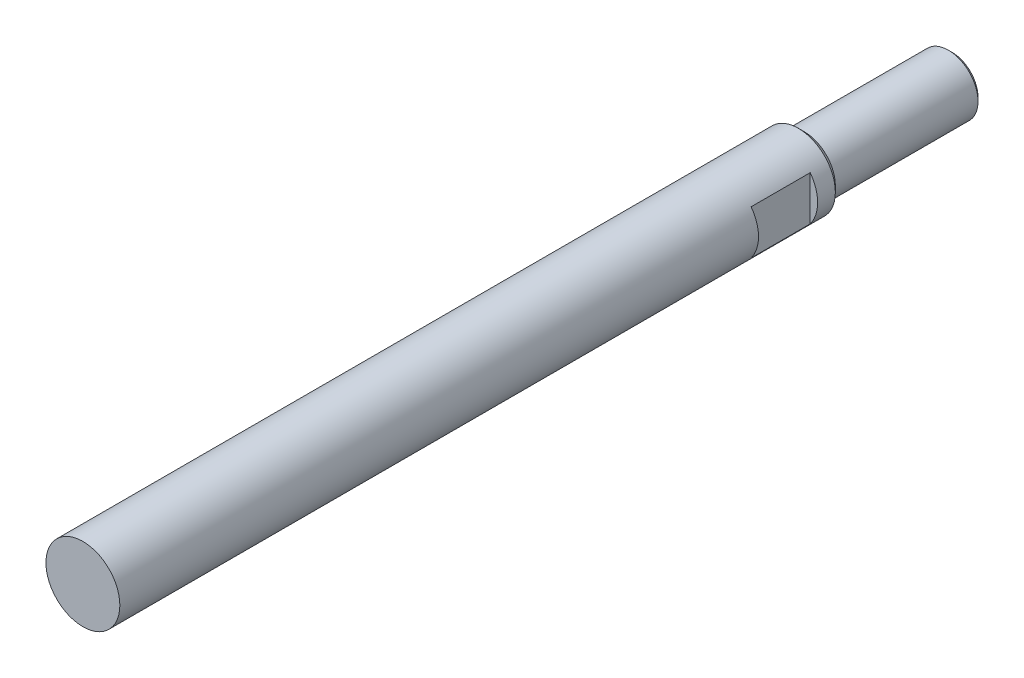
ISO-10303-21;
HEADER;
FILE_DESCRIPTION(('STEP AP214'),'2;1');
FILE_NAME('part.step','',(''),(''),'','','');
FILE_SCHEMA(('AUTOMOTIVE_DESIGN { 1 0 10303 214 1 1 1 1 }'));
ENDSEC;
DATA;
#1=APPLICATION_CONTEXT('core data for automotive mechanical design processes');
#2=APPLICATION_PROTOCOL_DEFINITION('international standard','automotive_design',2000,#1);
#3=PRODUCT_CONTEXT('',#1,'mechanical');
#4=PRODUCT('Part','Part','',(#3));
#5=PRODUCT_RELATED_PRODUCT_CATEGORY('part','',(#4));
#6=PRODUCT_DEFINITION_FORMATION('','',#4);
#7=PRODUCT_DEFINITION_CONTEXT('part definition',#1,'design');
#8=PRODUCT_DEFINITION('design','',#6,#7);
#9=PRODUCT_DEFINITION_SHAPE('','',#8);
#10=(LENGTH_UNIT() NAMED_UNIT(*) SI_UNIT(.MILLI.,.METRE.));
#11=(NAMED_UNIT(*) PLANE_ANGLE_UNIT() SI_UNIT($,.RADIAN.));
#12=(NAMED_UNIT(*) SI_UNIT($,.STERADIAN.) SOLID_ANGLE_UNIT());
#13=UNCERTAINTY_MEASURE_WITH_UNIT(LENGTH_MEASURE(1.E-05),#10,'distance_accuracy_value','');
#14=(GEOMETRIC_REPRESENTATION_CONTEXT(3) GLOBAL_UNCERTAINTY_ASSIGNED_CONTEXT((#13)) GLOBAL_UNIT_ASSIGNED_CONTEXT((#10,
#11,#12)) REPRESENTATION_CONTEXT('',''));
#15=CARTESIAN_POINT('',(0.,0.,0.));
#16=DIRECTION('',(0.,0.,1.));
#17=DIRECTION('',(1.,0.,0.));
#18=AXIS2_PLACEMENT_3D('',#15,#16,#17);
#19=CARTESIAN_POINT('',(0.,0.,0.));
#20=DIRECTION('',(0.,0.,1.));
#21=DIRECTION('',(1.,0.,0.));
#22=AXIS2_PLACEMENT_3D('',#19,#20,#21);
#23=PLANE('',#22);
#24=CARTESIAN_POINT('',(0.,0.,0.));
#25=DIRECTION('',(0.,0.,1.));
#26=DIRECTION('',(1.,0.,0.));
#27=AXIS2_PLACEMENT_3D('',#24,#25,#26);
#28=CIRCLE('',#27,10.4999999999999);
#29=CARTESIAN_POINT('',(10.499999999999,1.37251321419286E-13,0.));
#30=VERTEX_POINT('',#29);
#31=EDGE_CURVE('E99',#30,#30,#28,.F.);
#32=ORIENTED_EDGE('',*,*,#31,.T.);
#33=EDGE_LOOP('',(#32));
#34=FACE_BOUND('',#33,.T.);
#35=CARTESIAN_POINT('',(0.,0.,0.));
#36=DIRECTION('',(0.,0.,1.));
#37=DIRECTION('',(1.,0.,0.));
#38=AXIS2_PLACEMENT_3D('',#35,#36,#37);
#39=CIRCLE('',#38,10.);
#40=CARTESIAN_POINT('',(9.99999999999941,-2.11497486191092E-13,0.));
#41=VERTEX_POINT('',#40);
#42=EDGE_CURVE('E111',#41,#41,#39,.F.);
#43=ORIENTED_EDGE('',*,*,#42,.F.);
#44=EDGE_LOOP('',(#43));
#45=FACE_BOUND('',#44,.T.);
#46=ADVANCED_FACE('F32',(#34,#45),#23,.F.);
#47=CARTESIAN_POINT('',(-8.04911692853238E-13,-5.82867087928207E-13,244.));
#48=DIRECTION('',(0.,0.,-1.));
#49=DIRECTION('',(-1.,0.,0.));
#50=AXIS2_PLACEMENT_3D('',#47,#48,#49);
#51=CYLINDRICAL_SURFACE('',#50,12.5);
#52=DIRECTION('',(0.,0.,-1.));
#53=VECTOR('',#52,1.);
#54=CARTESIAN_POINT('',(-10.0000000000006,-7.50000000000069,244.));
#55=LINE('',#54,#53);
#56=CARTESIAN_POINT('',(-10.0000000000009,-7.50000000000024,27.9929982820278));
#57=VERTEX_POINT('',#56);
#58=CARTESIAN_POINT('',(-10.000000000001,-7.50000000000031,7.99299828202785));
#59=VERTEX_POINT('',#58);
#60=EDGE_CURVE('E40',#57,#59,#55,.T.);
#61=ORIENTED_EDGE('',*,*,#60,.T.);
#62=CARTESIAN_POINT('',(-6.66133814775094E-13,-2.56739074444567E-13,7.99299828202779));
#63=DIRECTION('',(0.,0.,-1.));
#64=DIRECTION('',(-1.,0.,0.));
#65=AXIS2_PLACEMENT_3D('',#62,#63,#64);
#66=CIRCLE('',#65,12.5);
#67=CARTESIAN_POINT('',(-10.0000000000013,7.49999999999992,7.99299828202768));
#68=VERTEX_POINT('',#67);
#69=EDGE_CURVE('E11',#59,#68,#66,.T.);
#70=ORIENTED_EDGE('',*,*,#69,.T.);
#71=DIRECTION('',(0.,0.,-1.));
#72=VECTOR('',#71,1.);
#73=CARTESIAN_POINT('',(-10.000000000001,7.49999999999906,244.));
#74=LINE('',#73,#72);
#75=CARTESIAN_POINT('',(-10.0000000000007,7.49999999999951,27.9929982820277));
#76=VERTEX_POINT('',#75);
#77=EDGE_CURVE('E76',#68,#76,#74,.F.);
#78=ORIENTED_EDGE('',*,*,#77,.T.);
#79=CARTESIAN_POINT('',(-7.21644966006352E-13,-5.13478148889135E-13,27.9929982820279));
#80=DIRECTION('',(0.,0.,1.));
#81=DIRECTION('',(1.,0.,0.));
#82=AXIS2_PLACEMENT_3D('',#79,#80,#81);
#83=CIRCLE('',#82,12.5);
#84=EDGE_CURVE('E71',#76,#57,#83,.T.);
#85=ORIENTED_EDGE('',*,*,#84,.T.);
#86=EDGE_LOOP('',(#61,#70,#78,#85));
#87=FACE_BOUND('',#86,.T.);
#88=DIRECTION('',(0.,0.,-1.));
#89=VECTOR('',#88,1.);
#90=CARTESIAN_POINT('',(9.99999999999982,-7.50000000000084,243.999999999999));
#91=LINE('',#90,#89);
#92=CARTESIAN_POINT('',(9.99999999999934,-7.50000000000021,7.9929982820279));
#93=VERTEX_POINT('',#92);
#94=CARTESIAN_POINT('',(9.99999999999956,-7.50000000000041,27.9929982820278));
#95=VERTEX_POINT('',#94);
#96=EDGE_CURVE('E93',#93,#95,#91,.F.);
#97=ORIENTED_EDGE('',*,*,#96,.T.);
#98=CARTESIAN_POINT('',(-7.21644966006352E-13,-5.13478148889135E-13,27.9929982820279));
#99=DIRECTION('',(0.,0.,0.999999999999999));
#100=DIRECTION('',(1.,0.,0.));
#101=AXIS2_PLACEMENT_3D('',#98,#99,#100);
#102=CIRCLE('',#101,12.5);
#103=CARTESIAN_POINT('',(9.99999999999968,7.4999999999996,27.9929982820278));
#104=VERTEX_POINT('',#103);
#105=EDGE_CURVE('E77',#95,#104,#102,.T.);
#106=ORIENTED_EDGE('',*,*,#105,.T.);
#107=DIRECTION('',(0.,0.,-1.));
#108=VECTOR('',#107,1.);
#109=CARTESIAN_POINT('',(9.99999999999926,7.49999999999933,243.999999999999));
#110=LINE('',#109,#108);
#111=CARTESIAN_POINT('',(9.99999999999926,7.50000000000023,7.99299828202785));
#112=VERTEX_POINT('',#111);
#113=EDGE_CURVE('E90',#104,#112,#110,.T.);
#114=ORIENTED_EDGE('',*,*,#113,.T.);
#115=CARTESIAN_POINT('',(-6.66133814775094E-13,-2.56739074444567E-13,7.99299828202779));
#116=DIRECTION('',(0.,0.,-1.));
#117=DIRECTION('',(-1.,0.,0.));
#118=AXIS2_PLACEMENT_3D('',#115,#116,#117);
#119=CIRCLE('',#118,12.5);
#120=EDGE_CURVE('E96',#112,#93,#119,.T.);
#121=ORIENTED_EDGE('',*,*,#120,.T.);
#122=EDGE_LOOP('',(#97,#106,#114,#121));
#123=FACE_BOUND('',#122,.T.);
#124=CARTESIAN_POINT('',(-7.7715611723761E-13,1.38777878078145E-13,2.00000000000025));
#125=DIRECTION('',(0.,0.,1.));
#126=DIRECTION('',(1.,0.,0.));
#127=AXIS2_PLACEMENT_3D('',#124,#125,#126);
#128=CIRCLE('',#127,12.5);
#129=CARTESIAN_POINT('',(12.4999999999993,1.31145094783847E-13,2.00000000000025));
#130=VERTEX_POINT('',#129);
#131=EDGE_CURVE('E102',#130,#130,#128,.T.);
#132=ORIENTED_EDGE('',*,*,#131,.T.);
#133=EDGE_LOOP('',(#132));
#134=FACE_BOUND('',#133,.T.);
#135=CARTESIAN_POINT('',(-8.04911692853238E-13,-5.82867087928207E-13,244.));
#136=DIRECTION('',(0.,0.,1.));
#137=DIRECTION('',(1.,0.,0.));
#138=AXIS2_PLACEMENT_3D('',#135,#136,#137);
#139=CIRCLE('',#138,12.5);
#140=CARTESIAN_POINT('',(12.4999999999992,-5.90499871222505E-13,244.));
#141=VERTEX_POINT('',#140);
#142=EDGE_CURVE('E114',#141,#141,#139,.T.);
#143=ORIENTED_EDGE('',*,*,#142,.F.);
#144=EDGE_LOOP('',(#143));
#145=FACE_BOUND('',#144,.T.);
#146=ADVANCED_FACE('F34',(#87,#123,#134,#145),#51,.T.);
#147=CARTESIAN_POINT('',(-8.04911692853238E-13,-5.82867087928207E-13,244.));
#148=DIRECTION('',(0.,0.,1.));
#149=DIRECTION('',(1.,0.,0.));
#150=AXIS2_PLACEMENT_3D('',#147,#148,#149);
#151=PLANE('',#150);
#152=ORIENTED_EDGE('',*,*,#142,.T.);
#153=EDGE_LOOP('',(#152));
#154=FACE_BOUND('',#153,.T.);
#155=ADVANCED_FACE('F139',(#154),#151,.T.);
#156=CARTESIAN_POINT('',(-6.38378239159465E-13,0.,-49.9999999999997));
#157=DIRECTION('',(0.,0.,1.));
#158=DIRECTION('',(1.,0.,0.));
#159=AXIS2_PLACEMENT_3D('',#156,#157,#158);
#160=CYLINDRICAL_SURFACE('',#159,10.);
#161=CARTESIAN_POINT('',(-4.44089209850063E-13,-1.73472347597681E-13,-48.7499999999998));
#162=DIRECTION('',(0.,0.,-1.));
#163=DIRECTION('',(-1.,0.,0.));
#164=AXIS2_PLACEMENT_3D('',#161,#162,#163);
#165=CIRCLE('',#164,10.);
#166=CARTESIAN_POINT('',(9.9999999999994,0.,-48.7499999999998));
#167=VERTEX_POINT('',#166);
#168=EDGE_CURVE('E105',#167,#167,#165,.F.);
#169=CARTESIAN_POINT('',(9.9999999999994,0.,-48.7499999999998));
#170=CARTESIAN_POINT('',(9.9999999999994,0.,-48.2421874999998));
#171=CARTESIAN_POINT('',(9.9999999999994,0.,-47.7343749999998));
#172=CARTESIAN_POINT('',(9.9999999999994,0.,-46.7187499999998));
#173=CARTESIAN_POINT('',(9.9999999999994,0.,-46.2109374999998));
#174=CARTESIAN_POINT('',(9.9999999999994,-1.01108357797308E-13,-45.1953124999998));
#175=CARTESIAN_POINT('',(9.9999999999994,-1.02348685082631E-13,-44.6874999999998));
#176=CARTESIAN_POINT('',(9.9999999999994,-1.04829339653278E-13,-43.6718749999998));
#177=CARTESIAN_POINT('',(9.9999999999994,-1.06069666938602E-13,-43.1640624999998));
#178=CARTESIAN_POINT('',(9.9999999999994,-1.08550321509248E-13,-42.1484374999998));
#179=CARTESIAN_POINT('',(9.9999999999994,-1.09790648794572E-13,-41.6406249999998));
#180=CARTESIAN_POINT('',(9.9999999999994,-1.12271303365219E-13,-40.6249999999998));
#181=CARTESIAN_POINT('',(9.9999999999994,-1.13511630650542E-13,-40.1171874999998));
#182=CARTESIAN_POINT('',(9.9999999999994,-1.15992285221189E-13,-39.1015624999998));
#183=CARTESIAN_POINT('',(9.9999999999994,-1.17232612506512E-13,-38.5937499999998));
#184=CARTESIAN_POINT('',(9.9999999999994,-1.19713267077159E-13,-37.5781249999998));
#185=CARTESIAN_POINT('',(9.9999999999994,-1.20953594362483E-13,-37.0703124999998));
#186=CARTESIAN_POINT('',(9.9999999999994,-1.23434248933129E-13,-36.0546874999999));
#187=CARTESIAN_POINT('',(9.9999999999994,-1.24674576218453E-13,-35.5468749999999));
#188=CARTESIAN_POINT('',(9.9999999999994,-1.271552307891E-13,-34.5312499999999));
#189=CARTESIAN_POINT('',(9.9999999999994,-1.28395558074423E-13,-34.0234374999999));
#190=CARTESIAN_POINT('',(9.9999999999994,-1.3087621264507E-13,-33.0078124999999));
#191=CARTESIAN_POINT('',(9.9999999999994,-1.32116539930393E-13,-32.4999999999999));
#192=CARTESIAN_POINT('',(9.9999999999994,-1.3459719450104E-13,-31.4843749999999));
#193=CARTESIAN_POINT('',(9.9999999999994,-1.35837521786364E-13,-30.9765624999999));
#194=CARTESIAN_POINT('',(9.9999999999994,-1.3831817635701E-13,-29.9609374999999));
#195=CARTESIAN_POINT('',(9.9999999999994,-1.39558503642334E-13,-29.4531249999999));
#196=CARTESIAN_POINT('',(9.9999999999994,-1.42039158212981E-13,-28.4374999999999));
#197=CARTESIAN_POINT('',(9.9999999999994,-1.43279485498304E-13,-27.9296874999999));
#198=CARTESIAN_POINT('',(9.9999999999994,-1.45760140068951E-13,-26.9140624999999));
#199=CARTESIAN_POINT('',(9.9999999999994,-1.47000467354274E-13,-26.4062499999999));
#200=CARTESIAN_POINT('',(9.9999999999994,-1.49481121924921E-13,-25.3906249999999));
#201=CARTESIAN_POINT('',(9.9999999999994,-1.50721449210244E-13,-24.8828124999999));
#202=CARTESIAN_POINT('',(9.9999999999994,-1.53202103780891E-13,-23.8671874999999));
#203=CARTESIAN_POINT('',(9.9999999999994,-1.54442431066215E-13,-23.3593749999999));
#204=CARTESIAN_POINT('',(9.9999999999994,-1.56923085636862E-13,-22.3437499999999));
#205=CARTESIAN_POINT('',(9.9999999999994,-1.58163412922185E-13,-21.8359374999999));
#206=CARTESIAN_POINT('',(9.9999999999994,-1.60644067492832E-13,-20.8203124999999));
#207=CARTESIAN_POINT('',(9.9999999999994,-1.61884394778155E-13,-20.3124999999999));
#208=CARTESIAN_POINT('',(9.9999999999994,-1.64365049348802E-13,-19.2968749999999));
#209=CARTESIAN_POINT('',(9.9999999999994,-1.65605376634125E-13,-18.7890624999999));
#210=CARTESIAN_POINT('',(9.9999999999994,-1.68086031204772E-13,-17.7734374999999));
#211=CARTESIAN_POINT('',(9.9999999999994,-1.69326358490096E-13,-17.2656249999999));
#212=CARTESIAN_POINT('',(9.9999999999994,-1.71807013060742E-13,-16.2499999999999));
#213=CARTESIAN_POINT('',(9.9999999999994,-1.73047340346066E-13,-15.7421874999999));
#214=CARTESIAN_POINT('',(9.9999999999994,-1.75527994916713E-13,-14.7265624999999));
#215=CARTESIAN_POINT('',(9.9999999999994,-1.76768322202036E-13,-14.2187499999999));
#216=CARTESIAN_POINT('',(9.9999999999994,-1.79248976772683E-13,-13.2031249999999));
#217=CARTESIAN_POINT('',(9.9999999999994,-1.80489304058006E-13,-12.6953124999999));
#218=CARTESIAN_POINT('',(9.9999999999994,-1.82969958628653E-13,-11.6796875));
#219=CARTESIAN_POINT('',(9.9999999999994,-1.84210285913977E-13,-11.171875));
#220=CARTESIAN_POINT('',(9.9999999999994,-1.86690940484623E-13,-10.15625));
#221=CARTESIAN_POINT('',(9.9999999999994,-1.87931267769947E-13,-9.64843749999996));
#222=CARTESIAN_POINT('',(9.9999999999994,-1.90411922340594E-13,-8.63281249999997));
#223=CARTESIAN_POINT('',(9.9999999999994,-1.91652249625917E-13,-8.12499999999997));
#224=CARTESIAN_POINT('',(9.9999999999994,-1.94132904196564E-13,-7.10937499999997));
#225=CARTESIAN_POINT('',(9.99999999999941,-1.95373231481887E-13,-6.60156249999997));
#226=CARTESIAN_POINT('',(9.99999999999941,-1.97853886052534E-13,-5.58593749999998));
#227=CARTESIAN_POINT('',(9.99999999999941,-1.99094213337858E-13,-5.07812499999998));
#228=CARTESIAN_POINT('',(9.99999999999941,-2.01574867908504E-13,-4.06249999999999));
#229=CARTESIAN_POINT('',(9.99999999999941,-2.02815195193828E-13,-3.55468749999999));
#230=CARTESIAN_POINT('',(9.99999999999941,-2.05295849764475E-13,-2.53906249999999));
#231=CARTESIAN_POINT('',(9.99999999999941,-2.06536177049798E-13,-2.03124999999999));
#232=CARTESIAN_POINT('',(9.99999999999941,-2.09016831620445E-13,-1.015625));
#233=CARTESIAN_POINT('',(9.99999999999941,-2.10257158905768E-13,-0.507812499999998));
#234=CARTESIAN_POINT('',(9.99999999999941,-2.11497486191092E-13,0.));
#235=B_SPLINE_CURVE_WITH_KNOTS('',3,(#169,#170,#171,#172,#173,#174,#175,#176,#177,#178,#179,
#180,#181,#182,#183,#184,#185,#186,#187,#188,#189,#190,#191,#192,#193,#194,#195,#196,#197,#198,
#199,#200,#201,#202,#203,#204,#205,#206,#207,#208,#209,#210,#211,#212,#213,#214,#215,#216,#217,
#218,#219,#220,#221,#222,#223,#224,#225,#226,#227,#228,#229,#230,#231,#232,#233,#234),
.UNSPECIFIED.,.F.,.F.,(4,2,2,2,2,2,2,2,2,2,2,2,2,2,2,2,2,2,2,2,2,2,2,2,2,2,2,2,2,2,2,2,4),(0.,
1.5234375,3.04687499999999,4.57031249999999,6.09374999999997,7.61718749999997,9.14062499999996,
10.6640625,12.1875,13.7109374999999,15.2343749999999,16.7578124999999,18.2812499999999,
19.8046874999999,21.3281249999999,22.8515624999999,24.3749999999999,25.8984374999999,
27.4218749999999,28.9453124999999,30.4687499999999,31.9921874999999,33.5156249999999,
35.0390624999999,36.5624999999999,38.0859374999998,39.6093749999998,41.1328124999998,
42.6562499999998,44.1796874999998,45.7031249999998,47.2265624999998,48.7499999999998),.UNSPECIFIED.);
#236=EDGE_CURVE('BSEAM142',#167,#41,#235,.T.);
#237=ORIENTED_EDGE('',*,*,#168,.T.);
#238=ORIENTED_EDGE('',*,*,#42,.T.);
#239=ORIENTED_EDGE('',*,*,#236,.T.);
#240=ORIENTED_EDGE('',*,*,#236,.F.);
#241=EDGE_LOOP('',(#237,#239,#238,#240));
#242=FACE_BOUND('',#241,.T.);
#243=ADVANCED_FACE('F142',(#242),#160,.T.);
#244=CARTESIAN_POINT('',(-6.38378239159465E-13,0.,-49.9999999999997));
#245=DIRECTION('',(0.,0.,-1.));
#246=DIRECTION('',(-1.,0.,0.));
#247=AXIS2_PLACEMENT_3D('',#244,#245,#246);
#248=PLANE('',#247);
#249=CARTESIAN_POINT('',(-6.38378239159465E-13,0.,-49.9999999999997));
#250=DIRECTION('',(0.,0.,-1.));
#251=DIRECTION('',(-1.,0.,0.));
#252=AXIS2_PLACEMENT_3D('',#249,#250,#251);
#253=CIRCLE('',#252,8.75);
#254=CARTESIAN_POINT('',(8.7499999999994,0.,-49.9999999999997));
#255=VERTEX_POINT('',#254);
#256=EDGE_CURVE('E108',#255,#255,#253,.T.);
#257=ORIENTED_EDGE('',*,*,#256,.T.);
#258=EDGE_LOOP('',(#257));
#259=FACE_BOUND('',#258,.T.);
#260=ADVANCED_FACE('F149',(#259),#248,.T.);
#261=CARTESIAN_POINT('',(-6.38378239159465E-13,0.,-49.9999999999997));
#262=DIRECTION('',(0.,0.,1.));
#263=DIRECTION('',(1.,0.,0.));
#264=AXIS2_PLACEMENT_3D('',#261,#262,#263);
#265=CONICAL_SURFACE('',#264,8.75,0.785398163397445);
#266=CARTESIAN_POINT('',(9.9999999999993,0.,-48.7499999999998));
#267=CARTESIAN_POINT('',(9.98697916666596,0.,-48.7630208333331));
#268=CARTESIAN_POINT('',(9.97395833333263,0.,-48.7760416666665));
#269=CARTESIAN_POINT('',(9.94791666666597,0.,-48.8020833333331));
#270=CARTESIAN_POINT('',(9.93489583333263,0.,-48.8151041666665));
#271=CARTESIAN_POINT('',(9.90885416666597,0.,-48.8411458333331));
#272=CARTESIAN_POINT('',(9.89583333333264,0.,-48.8541666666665));
#273=CARTESIAN_POINT('',(9.86979166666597,0.,-48.8802083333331));
#274=CARTESIAN_POINT('',(9.85677083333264,0.,-48.8932291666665));
#275=CARTESIAN_POINT('',(9.83072916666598,0.,-48.9192708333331));
#276=CARTESIAN_POINT('',(9.81770833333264,0.,-48.9322916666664));
#277=CARTESIAN_POINT('',(9.79166666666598,0.,-48.9583333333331));
#278=CARTESIAN_POINT('',(9.77864583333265,0.,-48.9713541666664));
#279=CARTESIAN_POINT('',(9.75260416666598,0.,-48.9973958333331));
#280=CARTESIAN_POINT('',(9.73958333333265,0.,-49.0104166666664));
#281=CARTESIAN_POINT('',(9.71354166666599,0.,-49.0364583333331));
#282=CARTESIAN_POINT('',(9.70052083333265,0.,-49.0494791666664));
#283=CARTESIAN_POINT('',(9.67447916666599,0.,-49.0755208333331));
#284=CARTESIAN_POINT('',(9.66145833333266,0.,-49.0885416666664));
#285=CARTESIAN_POINT('',(9.63541666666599,0.,-49.1145833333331));
#286=CARTESIAN_POINT('',(9.62239583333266,0.,-49.1276041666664));
#287=CARTESIAN_POINT('',(9.59635416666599,0.,-49.1536458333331));
#288=CARTESIAN_POINT('',(9.58333333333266,0.,-49.1666666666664));
#289=CARTESIAN_POINT('',(9.557291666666,0.,-49.1927083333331));
#290=CARTESIAN_POINT('',(9.54427083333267,0.,-49.2057291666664));
#291=CARTESIAN_POINT('',(9.518229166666,0.,-49.2317708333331));
#292=CARTESIAN_POINT('',(9.50520833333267,0.,-49.2447916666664));
#293=CARTESIAN_POINT('',(9.479166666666,0.,-49.2708333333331));
#294=CARTESIAN_POINT('',(9.46614583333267,0.,-49.2838541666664));
#295=CARTESIAN_POINT('',(9.44010416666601,0.,-49.3098958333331));
#296=CARTESIAN_POINT('',(9.42708333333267,0.,-49.3229166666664));
#297=CARTESIAN_POINT('',(9.40104166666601,0.,-49.3489583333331));
#298=CARTESIAN_POINT('',(9.38802083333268,0.,-49.3619791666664));
#299=CARTESIAN_POINT('',(9.36197916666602,0.,-49.3880208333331));
#300=CARTESIAN_POINT('',(9.34895833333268,0.,-49.4010416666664));
#301=CARTESIAN_POINT('',(9.32291666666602,0.,-49.4270833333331));
#302=CARTESIAN_POINT('',(9.30989583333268,0.,-49.4401041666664));
#303=CARTESIAN_POINT('',(9.28385416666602,0.,-49.4661458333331));
#304=CARTESIAN_POINT('',(9.27083333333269,0.,-49.4791666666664));
#305=CARTESIAN_POINT('',(9.24479166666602,0.,-49.5052083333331));
#306=CARTESIAN_POINT('',(9.23177083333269,0.,-49.5182291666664));
#307=CARTESIAN_POINT('',(9.20572916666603,0.,-49.5442708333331));
#308=CARTESIAN_POINT('',(9.1927083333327,0.,-49.5572916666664));
#309=CARTESIAN_POINT('',(9.16666666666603,0.,-49.5833333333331));
#310=CARTESIAN_POINT('',(9.1536458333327,0.,-49.5963541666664));
#311=CARTESIAN_POINT('',(9.12760416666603,0.,-49.6223958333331));
#312=CARTESIAN_POINT('',(9.1145833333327,0.,-49.6354166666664));
#313=CARTESIAN_POINT('',(9.08854166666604,0.,-49.6614583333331));
#314=CARTESIAN_POINT('',(9.07552083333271,0.,-49.6744791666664));
#315=CARTESIAN_POINT('',(9.04947916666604,0.,-49.7005208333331));
#316=CARTESIAN_POINT('',(9.03645833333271,0.,-49.7135416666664));
#317=CARTESIAN_POINT('',(9.01041666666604,0.,-49.7395833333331));
#318=CARTESIAN_POINT('',(8.99739583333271,0.,-49.7526041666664));
#319=CARTESIAN_POINT('',(8.97135416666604,0.,-49.7786458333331));
#320=CARTESIAN_POINT('',(8.95833333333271,0.,-49.7916666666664));
#321=CARTESIAN_POINT('',(8.93229166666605,0.,-49.8177083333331));
#322=CARTESIAN_POINT('',(8.91927083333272,0.,-49.8307291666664));
#323=CARTESIAN_POINT('',(8.89322916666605,0.,-49.856770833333));
#324=CARTESIAN_POINT('',(8.88020833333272,0.,-49.8697916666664));
#325=CARTESIAN_POINT('',(8.85416666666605,0.,-49.895833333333));
#326=CARTESIAN_POINT('',(8.84114583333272,0.,-49.9088541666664));
#327=CARTESIAN_POINT('',(8.81510416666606,0.,-49.934895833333));
#328=CARTESIAN_POINT('',(8.80208333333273,0.,-49.9479166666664));
#329=CARTESIAN_POINT('',(8.77604166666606,0.,-49.973958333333));
#330=CARTESIAN_POINT('',(8.76302083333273,0.,-49.9869791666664));
#331=CARTESIAN_POINT('',(8.7499999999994,0.,-49.9999999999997));
#332=B_SPLINE_CURVE_WITH_KNOTS('',3,(#266,#267,#268,#269,#270,#271,#272,#273,#274,#275,#276,
#277,#278,#279,#280,#281,#282,#283,#284,#285,#286,#287,#288,#289,#290,#291,#292,#293,#294,#295,
#296,#297,#298,#299,#300,#301,#302,#303,#304,#305,#306,#307,#308,#309,#310,#311,#312,#313,#314,
#315,#316,#317,#318,#319,#320,#321,#322,#323,#324,#325,#326,#327,#328,#329,#330,#331),
.UNSPECIFIED.,.F.,.F.,(4,2,2,2,2,2,2,2,2,2,2,2,2,2,2,2,2,2,2,2,2,2,2,2,2,2,2,2,2,2,2,2,4),(0.,
0.0552427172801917,0.110485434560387,0.165728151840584,0.220970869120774,0.276213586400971,
0.331456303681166,0.386699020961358,0.441941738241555,0.49718445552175,0.552427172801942,
0.607669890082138,0.662912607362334,0.718155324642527,0.773398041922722,0.828640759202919,
0.883883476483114,0.939126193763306,0.994368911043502,1.0496116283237,1.10485434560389,
1.16009706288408,1.21533978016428,1.27058249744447,1.32582521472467,1.38106793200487,
1.43631064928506,1.49155336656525,1.54679608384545,1.60203880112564,1.65728151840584,
1.71252423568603,1.76776695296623),.UNSPECIFIED.);
#333=EDGE_CURVE('BSEAM156',#167,#255,#332,.T.);
#334=ORIENTED_EDGE('',*,*,#168,.F.);
#335=ORIENTED_EDGE('',*,*,#256,.F.);
#336=ORIENTED_EDGE('',*,*,#333,.T.);
#337=ORIENTED_EDGE('',*,*,#333,.F.);
#338=EDGE_LOOP('',(#334,#336,#335,#337));
#339=FACE_BOUND('',#338,.T.);
#340=ADVANCED_FACE('F156',(#339),#265,.T.);
#341=CARTESIAN_POINT('',(-7.7715611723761E-13,1.38777878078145E-13,2.00000000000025));
#342=DIRECTION('',(0.,0.,1.));
#343=DIRECTION('',(1.,0.,0.));
#344=AXIS2_PLACEMENT_3D('',#341,#342,#343);
#345=CONICAL_SURFACE('',#344,12.5,0.785398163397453);
#346=CARTESIAN_POINT('',(10.499999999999,1.37251321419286E-13,0.));
#347=CARTESIAN_POINT('',(10.5208333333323,1.37187714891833E-13,0.0208333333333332));
#348=CARTESIAN_POINT('',(10.5416666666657,1.37124108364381E-13,0.0416666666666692));
#349=CARTESIAN_POINT('',(10.5833333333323,1.36996895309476E-13,0.0833333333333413));
#350=CARTESIAN_POINT('',(10.6041666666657,1.36933288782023E-13,0.104166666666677));
#351=CARTESIAN_POINT('',(10.6458333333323,1.36806075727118E-13,0.145833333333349));
#352=CARTESIAN_POINT('',(10.6666666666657,1.36742469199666E-13,0.166666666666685));
#353=CARTESIAN_POINT('',(10.7083333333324,1.36615256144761E-13,0.208333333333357));
#354=CARTESIAN_POINT('',(10.7291666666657,1.36551649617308E-13,0.229166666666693));
#355=CARTESIAN_POINT('',(10.7708333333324,1.36424436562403E-13,0.270833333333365));
#356=CARTESIAN_POINT('',(10.7916666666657,1.36360830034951E-13,0.2916666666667));
#357=CARTESIAN_POINT('',(10.8333333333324,1.36233616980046E-13,0.333333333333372));
#358=CARTESIAN_POINT('',(10.8541666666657,1.36170010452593E-13,0.354166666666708));
#359=CARTESIAN_POINT('',(10.8958333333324,1.36042797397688E-13,0.395833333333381));
#360=CARTESIAN_POINT('',(10.9166666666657,1.35979190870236E-13,0.416666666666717));
#361=CARTESIAN_POINT('',(10.9583333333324,1.35851977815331E-13,0.458333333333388));
#362=CARTESIAN_POINT('',(10.9791666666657,1.35788371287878E-13,0.479166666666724));
#363=CARTESIAN_POINT('',(11.0208333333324,1.35661158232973E-13,0.520833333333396));
#364=CARTESIAN_POINT('',(11.0416666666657,1.35597551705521E-13,0.541666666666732));
#365=CARTESIAN_POINT('',(11.0833333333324,1.35470338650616E-13,0.583333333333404));
#366=CARTESIAN_POINT('',(11.1041666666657,1.35406732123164E-13,0.60416666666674));
#367=CARTESIAN_POINT('',(11.1458333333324,1.35279519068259E-13,0.645833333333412));
#368=CARTESIAN_POINT('',(11.1666666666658,1.35215912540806E-13,0.666666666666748));
#369=CARTESIAN_POINT('',(11.2083333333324,1.35088699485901E-13,0.70833333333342));
#370=CARTESIAN_POINT('',(11.2291666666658,1.35025092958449E-13,0.729166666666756));
#371=CARTESIAN_POINT('',(11.2708333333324,1.34897879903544E-13,0.770833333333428));
#372=CARTESIAN_POINT('',(11.2916666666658,1.34834273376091E-13,0.791666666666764));
#373=CARTESIAN_POINT('',(11.3333333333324,1.34707060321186E-13,0.833333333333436));
#374=CARTESIAN_POINT('',(11.3541666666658,1.34643453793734E-13,0.854166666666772));
#375=CARTESIAN_POINT('',(11.3958333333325,1.34516240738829E-13,0.895833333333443));
#376=CARTESIAN_POINT('',(11.4166666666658,1.34452634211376E-13,0.916666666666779));
#377=CARTESIAN_POINT('',(11.4583333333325,1.34325421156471E-13,0.958333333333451));
#378=CARTESIAN_POINT('',(11.4791666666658,1.34261814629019E-13,0.979166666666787));
#379=CARTESIAN_POINT('',(11.5208333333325,1.34134601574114E-13,1.02083333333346));
#380=CARTESIAN_POINT('',(11.5416666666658,1.34070995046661E-13,1.04166666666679));
#381=CARTESIAN_POINT('',(11.5833333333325,1.33943781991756E-13,1.08333333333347));
#382=CARTESIAN_POINT('',(11.6041666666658,1.33880175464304E-13,1.1041666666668));
#383=CARTESIAN_POINT('',(11.6458333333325,1.33752962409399E-13,1.14583333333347));
#384=CARTESIAN_POINT('',(11.6666666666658,1.33689355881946E-13,1.16666666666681));
#385=CARTESIAN_POINT('',(11.7083333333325,1.33562142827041E-13,1.20833333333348));
#386=CARTESIAN_POINT('',(11.7291666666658,1.33498536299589E-13,1.22916666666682));
#387=CARTESIAN_POINT('',(11.7708333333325,1.33371323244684E-13,1.27083333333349));
#388=CARTESIAN_POINT('',(11.7916666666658,1.33307716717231E-13,1.29166666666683));
#389=CARTESIAN_POINT('',(11.8333333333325,1.33180503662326E-13,1.3333333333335));
#390=CARTESIAN_POINT('',(11.8541666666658,1.33116897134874E-13,1.35416666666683));
#391=CARTESIAN_POINT('',(11.8958333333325,1.32989684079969E-13,1.39583333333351));
#392=CARTESIAN_POINT('',(11.9166666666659,1.32926077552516E-13,1.41666666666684));
#393=CARTESIAN_POINT('',(11.9583333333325,1.32798864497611E-13,1.45833333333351));
#394=CARTESIAN_POINT('',(11.9791666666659,1.32735257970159E-13,1.47916666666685));
#395=CARTESIAN_POINT('',(12.0208333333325,1.32608044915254E-13,1.52083333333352));
#396=CARTESIAN_POINT('',(12.0416666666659,1.32544438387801E-13,1.54166666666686));
#397=CARTESIAN_POINT('',(12.0833333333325,1.32417225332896E-13,1.58333333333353));
#398=CARTESIAN_POINT('',(12.1041666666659,1.32353618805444E-13,1.60416666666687));
#399=CARTESIAN_POINT('',(12.1458333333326,1.32226405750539E-13,1.64583333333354));
#400=CARTESIAN_POINT('',(12.1666666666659,1.32162799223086E-13,1.66666666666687));
#401=CARTESIAN_POINT('',(12.2083333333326,1.32035586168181E-13,1.70833333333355));
#402=CARTESIAN_POINT('',(12.2291666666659,1.31971979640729E-13,1.72916666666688));
#403=CARTESIAN_POINT('',(12.2708333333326,1.31844766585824E-13,1.77083333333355));
#404=CARTESIAN_POINT('',(12.2916666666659,1.31781160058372E-13,1.79166666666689));
#405=CARTESIAN_POINT('',(12.3333333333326,1.31653947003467E-13,1.83333333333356));
#406=CARTESIAN_POINT('',(12.3541666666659,1.31590340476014E-13,1.8541666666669));
#407=CARTESIAN_POINT('',(12.3958333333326,1.31463127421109E-13,1.89583333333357));
#408=CARTESIAN_POINT('',(12.4166666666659,1.31399520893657E-13,1.91666666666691));
#409=CARTESIAN_POINT('',(12.4583333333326,1.31272307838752E-13,1.95833333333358));
#410=CARTESIAN_POINT('',(12.4791666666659,1.31208701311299E-13,1.97916666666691));
#411=CARTESIAN_POINT('',(12.4999999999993,1.31145094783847E-13,2.00000000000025));
#412=B_SPLINE_CURVE_WITH_KNOTS('',3,(#346,#347,#348,#349,#350,#351,#352,#353,#354,#355,#356,
#357,#358,#359,#360,#361,#362,#363,#364,#365,#366,#367,#368,#369,#370,#371,#372,#373,#374,#375,
#376,#377,#378,#379,#380,#381,#382,#383,#384,#385,#386,#387,#388,#389,#390,#391,#392,#393,#394,
#395,#396,#397,#398,#399,#400,#401,#402,#403,#404,#405,#406,#407,#408,#409,#410,#411),
.UNSPECIFIED.,.F.,.F.,(4,2,2,2,2,2,2,2,2,2,2,2,2,2,2,2,2,2,2,2,2,2,2,2,2,2,2,2,2,2,2,2,4),(0.,
0.0883883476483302,0.17677669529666,0.265165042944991,0.353553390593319,0.441941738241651,
0.53033008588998,0.61871843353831,0.707106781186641,0.795495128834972,0.883883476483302,
0.972271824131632,1.06066017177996,1.14904851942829,1.23743686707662,1.32582521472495,
1.41421356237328,1.50260191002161,1.59099025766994,1.67937860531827,1.7677669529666,
1.85615530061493,1.94454364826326,2.03293199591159,2.12132034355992,2.20970869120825,
2.29809703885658,2.38648538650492,2.47487373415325,2.56326208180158,2.6516504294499,
2.74003877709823,2.82842712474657),.UNSPECIFIED.);
#413=EDGE_CURVE('BSEAM164',#30,#130,#412,.T.);
#414=ORIENTED_EDGE('',*,*,#31,.F.);
#415=ORIENTED_EDGE('',*,*,#131,.F.);
#416=ORIENTED_EDGE('',*,*,#413,.T.);
#417=ORIENTED_EDGE('',*,*,#413,.F.);
#418=EDGE_LOOP('',(#414,#416,#415,#417));
#419=FACE_BOUND('',#418,.T.);
#420=ADVANCED_FACE('F164',(#419),#345,.T.);
#421=CARTESIAN_POINT('',(18.4525949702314,-15.0000000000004,27.9929982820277));
#422=DIRECTION('',(0.,0.,0.999999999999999));
#423=DIRECTION('',(1.,0.,0.));
#424=AXIS2_PLACEMENT_3D('',#421,#422,#423);
#425=PLANE('',#424);
#426=DIRECTION('',(0.,1.00000000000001,0.));
#427=VECTOR('',#426,1.);
#428=CARTESIAN_POINT('',(9.99999999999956,-15.0000000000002,27.9929982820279));
#429=LINE('',#428,#427);
#430=EDGE_CURVE('E117',#95,#104,#429,.T.);
#431=ORIENTED_EDGE('',*,*,#430,.T.);
#432=ORIENTED_EDGE('',*,*,#105,.F.);
#433=EDGE_LOOP('',(#431,#432));
#434=FACE_BOUND('',#433,.T.);
#435=ADVANCED_FACE('F170',(#434),#425,.F.);
#436=CARTESIAN_POINT('',(9.99999999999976,-15.0000000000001,7.99299828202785));
#437=DIRECTION('',(-1.,0.,0.));
#438=DIRECTION('',(0.,0.,1.));
#439=AXIS2_PLACEMENT_3D('',#436,#437,#438);
#440=PLANE('',#439);
#441=ORIENTED_EDGE('',*,*,#430,.F.);
#442=ORIENTED_EDGE('',*,*,#96,.F.);
#443=DIRECTION('',(0.,1.00000000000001,0.));
#444=VECTOR('',#443,1.);
#445=CARTESIAN_POINT('',(9.99999999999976,-15.0000000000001,7.99299828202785));
#446=LINE('',#445,#444);
#447=EDGE_CURVE('E53',#93,#112,#446,.T.);
#448=ORIENTED_EDGE('',*,*,#447,.T.);
#449=ORIENTED_EDGE('',*,*,#113,.F.);
#450=EDGE_LOOP('',(#441,#442,#448,#449));
#451=FACE_BOUND('',#450,.T.);
#452=ADVANCED_FACE('F131',(#451),#440,.F.);
#453=CARTESIAN_POINT('',(18.4525949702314,-15.0000000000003,7.99299828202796));
#454=DIRECTION('',(0.,0.,-1.));
#455=DIRECTION('',(-1.,0.,0.));
#456=AXIS2_PLACEMENT_3D('',#453,#454,#455);
#457=PLANE('',#456);
#458=ORIENTED_EDGE('',*,*,#447,.F.);
#459=ORIENTED_EDGE('',*,*,#120,.F.);
#460=EDGE_LOOP('',(#458,#459));
#461=FACE_BOUND('',#460,.T.);
#462=ADVANCED_FACE('F124',(#461),#457,.F.);
#463=CARTESIAN_POINT('',(-18.5699921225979,-15.0000000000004,7.99299828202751));
#464=DIRECTION('',(0.,0.,-1.));
#465=DIRECTION('',(-1.,0.,0.));
#466=AXIS2_PLACEMENT_3D('',#463,#464,#465);
#467=PLANE('',#466);
#468=DIRECTION('',(0.,1.00000000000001,0.));
#469=VECTOR('',#468,1.);
#470=CARTESIAN_POINT('',(-10.0000000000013,-15.0000000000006,7.99299828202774));
#471=LINE('',#470,#469);
#472=EDGE_CURVE('E83',#59,#68,#471,.T.);
#473=ORIENTED_EDGE('',*,*,#472,.T.);
#474=ORIENTED_EDGE('',*,*,#69,.F.);
#475=EDGE_LOOP('',(#473,#474));
#476=FACE_BOUND('',#475,.T.);
#477=ADVANCED_FACE('F122',(#476),#467,.F.);
#478=CARTESIAN_POINT('',(-10.0000000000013,-15.0000000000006,7.99299828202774));
#479=DIRECTION('',(1.,0.,0.));
#480=DIRECTION('',(0.,0.,-1.));
#481=AXIS2_PLACEMENT_3D('',#478,#479,#480);
#482=PLANE('',#481);
#483=DIRECTION('',(0.,1.00000000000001,0.));
#484=VECTOR('',#483,1.);
#485=CARTESIAN_POINT('',(-10.0000000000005,-15.0000000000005,27.9929982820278));
#486=LINE('',#485,#484);
#487=EDGE_CURVE('E46',#57,#76,#486,.T.);
#488=ORIENTED_EDGE('',*,*,#487,.T.);
#489=ORIENTED_EDGE('',*,*,#77,.F.);
#490=ORIENTED_EDGE('',*,*,#472,.F.);
#491=ORIENTED_EDGE('',*,*,#60,.F.);
#492=EDGE_LOOP('',(#488,#489,#490,#491));
#493=FACE_BOUND('',#492,.T.);
#494=ADVANCED_FACE('F80',(#493),#482,.F.);
#495=CARTESIAN_POINT('',(-18.5699921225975,-15.0000000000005,27.9929982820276));
#496=DIRECTION('',(0.,0.,1.));
#497=DIRECTION('',(1.,0.,0.));
#498=AXIS2_PLACEMENT_3D('',#495,#496,#497);
#499=PLANE('',#498);
#500=ORIENTED_EDGE('',*,*,#487,.F.);
#501=ORIENTED_EDGE('',*,*,#84,.F.);
#502=EDGE_LOOP('',(#500,#501));
#503=FACE_BOUND('',#502,.T.);
#504=ADVANCED_FACE('F72',(#503),#499,.F.);
#505=CLOSED_SHELL('',(#46,#146,#155,#243,#260,#340,#420,#435,#452,#462,#477,#494,#504));
#506=MANIFOLD_SOLID_BREP('B2',#505);
#507=ADVANCED_BREP_SHAPE_REPRESENTATION('',(#18,#506),#14);
#508=SHAPE_DEFINITION_REPRESENTATION(#9,#507);
ENDSEC;
END-ISO-10303-21;
